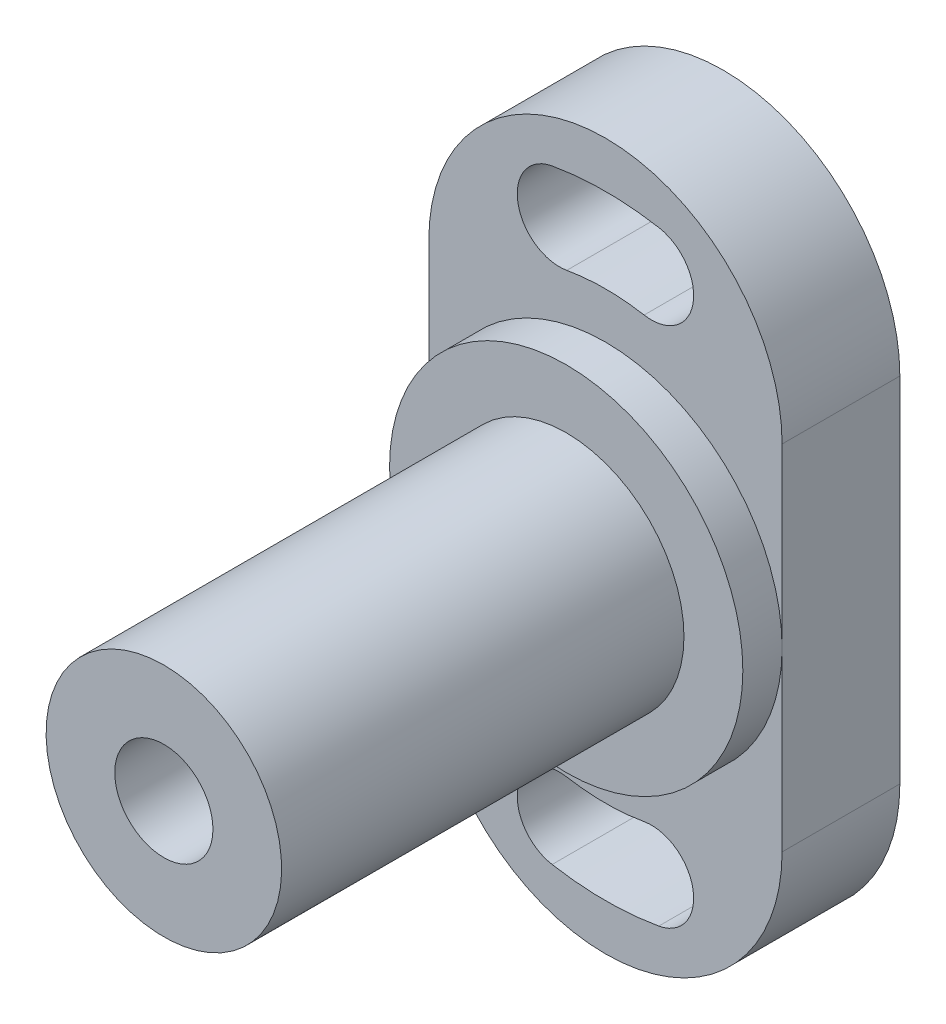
ISO-10303-21;
HEADER;
FILE_DESCRIPTION(('STEP AP214'),'2;1');
FILE_NAME('part.step','',(''),(''),'','','');
FILE_SCHEMA(('AUTOMOTIVE_DESIGN { 1 0 10303 214 1 1 1 1 }'));
ENDSEC;
DATA;
#1=APPLICATION_CONTEXT('core data for automotive mechanical design processes');
#2=APPLICATION_PROTOCOL_DEFINITION('international standard','automotive_design',2000,#1);
#3=PRODUCT_CONTEXT('',#1,'mechanical');
#4=PRODUCT('Part','Part','',(#3));
#5=PRODUCT_RELATED_PRODUCT_CATEGORY('part','',(#4));
#6=PRODUCT_DEFINITION_FORMATION('','',#4);
#7=PRODUCT_DEFINITION_CONTEXT('part definition',#1,'design');
#8=PRODUCT_DEFINITION('design','',#6,#7);
#9=PRODUCT_DEFINITION_SHAPE('','',#8);
#10=(LENGTH_UNIT() NAMED_UNIT(*) SI_UNIT(.MILLI.,.METRE.));
#11=(NAMED_UNIT(*) PLANE_ANGLE_UNIT() SI_UNIT($,.RADIAN.));
#12=(NAMED_UNIT(*) SI_UNIT($,.STERADIAN.) SOLID_ANGLE_UNIT());
#13=UNCERTAINTY_MEASURE_WITH_UNIT(LENGTH_MEASURE(1.E-05),#10,'distance_accuracy_value','');
#14=(GEOMETRIC_REPRESENTATION_CONTEXT(3) GLOBAL_UNCERTAINTY_ASSIGNED_CONTEXT((#13)) GLOBAL_UNIT_ASSIGNED_CONTEXT((#10,
#11,#12)) REPRESENTATION_CONTEXT('',''));
#15=CARTESIAN_POINT('',(0.,0.,0.));
#16=DIRECTION('',(0.,0.,1.));
#17=DIRECTION('',(1.,0.,0.));
#18=AXIS2_PLACEMENT_3D('',#15,#16,#17);
#19=CARTESIAN_POINT('',(0.,9.,6.));
#20=DIRECTION('',(0.,0.,1.));
#21=DIRECTION('',(0.,-1.,0.));
#22=AXIS2_PLACEMENT_3D('',#19,#20,#21);
#23=PLANE('',#22);
#24=CARTESIAN_POINT('',(0.,0.,6.));
#25=DIRECTION('',(0.,0.,-1.));
#26=DIRECTION('',(0.,1.,0.));
#27=AXIS2_PLACEMENT_3D('',#24,#25,#26);
#28=CIRCLE('',#27,9.);
#29=CARTESIAN_POINT('',(-9.,0.,6.));
#30=VERTEX_POINT('',#29);
#31=CARTESIAN_POINT('',(9.,0.,6.));
#32=VERTEX_POINT('',#31);
#33=EDGE_CURVE('E129',#30,#32,#28,.T.);
#34=ORIENTED_EDGE('',*,*,#33,.T.);
#35=DIRECTION('',(0.,1.,0.));
#36=VECTOR('',#35,1.);
#37=CARTESIAN_POINT('',(9.,9.,6.));
#38=LINE('',#37,#36);
#39=CARTESIAN_POINT('',(9.,9.,6.));
#40=VERTEX_POINT('',#39);
#41=EDGE_CURVE('E118',#32,#40,#38,.T.);
#42=ORIENTED_EDGE('',*,*,#41,.T.);
#43=CARTESIAN_POINT('',(0.,9.,6.));
#44=DIRECTION('',(0.,0.,1.));
#45=DIRECTION('',(0.,-1.,0.));
#46=AXIS2_PLACEMENT_3D('',#43,#44,#45);
#47=CIRCLE('',#46,9.);
#48=CARTESIAN_POINT('',(-9.,9.,6.));
#49=VERTEX_POINT('',#48);
#50=EDGE_CURVE('E213',#40,#49,#47,.T.);
#51=ORIENTED_EDGE('',*,*,#50,.T.);
#52=DIRECTION('',(0.,-1.,0.));
#53=VECTOR('',#52,1.);
#54=CARTESIAN_POINT('',(-9.,9.,6.));
#55=LINE('',#54,#53);
#56=EDGE_CURVE('E131',#49,#30,#55,.T.);
#57=ORIENTED_EDGE('',*,*,#56,.T.);
#58=EDGE_LOOP('',(#34,#42,#51,#57));
#59=FACE_BOUND('',#58,.T.);
#60=CARTESIAN_POINT('',(-2.34425039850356,13.2949046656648,6.));
#61=DIRECTION('',(0.,0.,1.));
#62=DIRECTION('',(0.,1.,0.));
#63=AXIS2_PLACEMENT_3D('',#60,#61,#62);
#64=CIRCLE('',#63,2.15);
#65=CARTESIAN_POINT('',(-2.71759398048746,15.412241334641,6.));
#66=VERTEX_POINT('',#65);
#67=CARTESIAN_POINT('',(-1.97090681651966,11.1775679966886,6.));
#68=VERTEX_POINT('',#67);
#69=EDGE_CURVE('E187',#66,#68,#64,.T.);
#70=ORIENTED_EDGE('',*,*,#69,.F.);
#71=CARTESIAN_POINT('',(0.,0.,6.));
#72=DIRECTION('',(0.,0.,1.));
#73=DIRECTION('',(0.,-1.,0.));
#74=AXIS2_PLACEMENT_3D('',#71,#72,#73);
#75=CIRCLE('',#74,15.65);
#76=CARTESIAN_POINT('',(2.71759398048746,15.412241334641,6.));
#77=VERTEX_POINT('',#76);
#78=EDGE_CURVE('E185',#77,#66,#75,.T.);
#79=ORIENTED_EDGE('',*,*,#78,.F.);
#80=CARTESIAN_POINT('',(2.34425039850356,13.2949046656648,6.));
#81=DIRECTION('',(0.,0.,1.));
#82=DIRECTION('',(0.,-1.,0.));
#83=AXIS2_PLACEMENT_3D('',#80,#81,#82);
#84=CIRCLE('',#83,2.15);
#85=CARTESIAN_POINT('',(1.97090681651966,11.1775679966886,6.));
#86=VERTEX_POINT('',#85);
#87=EDGE_CURVE('E192',#86,#77,#84,.T.);
#88=ORIENTED_EDGE('',*,*,#87,.F.);
#89=CARTESIAN_POINT('',(0.,0.,6.));
#90=DIRECTION('',(0.,0.,-1.));
#91=DIRECTION('',(0.,-1.,0.));
#92=AXIS2_PLACEMENT_3D('',#89,#90,#91);
#93=CIRCLE('',#92,11.35);
#94=EDGE_CURVE('E189',#68,#86,#93,.T.);
#95=ORIENTED_EDGE('',*,*,#94,.F.);
#96=EDGE_LOOP('',(#70,#79,#88,#95));
#97=FACE_BOUND('',#96,.T.);
#98=ADVANCED_FACE('F14',(#59,#97),#23,.T.);
#99=EDGE_CURVE('E30',#32,#30,#28,.T.);
#100=ORIENTED_EDGE('',*,*,#99,.T.);
#101=CARTESIAN_POINT('',(-9.,-9.,6.));
#102=VERTEX_POINT('',#101);
#103=EDGE_CURVE('E215',#30,#102,#55,.T.);
#104=ORIENTED_EDGE('',*,*,#103,.T.);
#105=CARTESIAN_POINT('',(0.,-9.,6.));
#106=DIRECTION('',(0.,0.,1.));
#107=DIRECTION('',(0.,1.,0.));
#108=AXIS2_PLACEMENT_3D('',#105,#106,#107);
#109=CIRCLE('',#108,9.);
#110=CARTESIAN_POINT('',(9.,-9.,6.));
#111=VERTEX_POINT('',#110);
#112=EDGE_CURVE('E113',#102,#111,#109,.T.);
#113=ORIENTED_EDGE('',*,*,#112,.T.);
#114=EDGE_CURVE('E108',#111,#32,#38,.T.);
#115=ORIENTED_EDGE('',*,*,#114,.T.);
#116=EDGE_LOOP('',(#100,#104,#113,#115));
#117=FACE_BOUND('',#116,.T.);
#118=CARTESIAN_POINT('',(0.,0.,6.));
#119=DIRECTION('',(0.,0.,-1.));
#120=DIRECTION('',(0.,1.,0.));
#121=AXIS2_PLACEMENT_3D('',#118,#119,#120);
#122=CIRCLE('',#121,11.35);
#123=CARTESIAN_POINT('',(1.97090681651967,-11.1775679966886,6.));
#124=VERTEX_POINT('',#123);
#125=CARTESIAN_POINT('',(-1.97090681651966,-11.1775679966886,6.));
#126=VERTEX_POINT('',#125);
#127=EDGE_CURVE('E158',#124,#126,#122,.T.);
#128=ORIENTED_EDGE('',*,*,#127,.F.);
#129=CARTESIAN_POINT('',(2.34425039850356,-13.2949046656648,6.));
#130=DIRECTION('',(0.,0.,1.));
#131=DIRECTION('',(0.,1.,0.));
#132=AXIS2_PLACEMENT_3D('',#129,#130,#131);
#133=CIRCLE('',#132,2.15);
#134=CARTESIAN_POINT('',(2.71759398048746,-15.412241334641,6.));
#135=VERTEX_POINT('',#134);
#136=EDGE_CURVE('E156',#135,#124,#133,.T.);
#137=ORIENTED_EDGE('',*,*,#136,.F.);
#138=CARTESIAN_POINT('',(0.,0.,6.));
#139=DIRECTION('',(0.,0.,1.));
#140=DIRECTION('',(0.,1.,0.));
#141=AXIS2_PLACEMENT_3D('',#138,#139,#140);
#142=CIRCLE('',#141,15.65);
#143=CARTESIAN_POINT('',(-2.71759398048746,-15.412241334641,6.));
#144=VERTEX_POINT('',#143);
#145=EDGE_CURVE('E162',#144,#135,#142,.T.);
#146=ORIENTED_EDGE('',*,*,#145,.F.);
#147=CARTESIAN_POINT('',(-2.34425039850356,-13.2949046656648,6.));
#148=DIRECTION('',(0.,0.,1.));
#149=DIRECTION('',(0.,-1.,0.));
#150=AXIS2_PLACEMENT_3D('',#147,#148,#149);
#151=CIRCLE('',#150,2.15);
#152=EDGE_CURVE('E160',#126,#144,#151,.T.);
#153=ORIENTED_EDGE('',*,*,#152,.F.);
#154=EDGE_LOOP('',(#128,#137,#146,#153));
#155=FACE_BOUND('',#154,.T.);
#156=ADVANCED_FACE('F110',(#117,#155),#23,.T.);
#157=CARTESIAN_POINT('',(0.,9.,0.));
#158=DIRECTION('',(0.,0.,1.));
#159=DIRECTION('',(0.,-1.,0.));
#160=AXIS2_PLACEMENT_3D('',#157,#158,#159);
#161=PLANE('',#160);
#162=CARTESIAN_POINT('',(0.,0.,0.));
#163=DIRECTION('',(0.,0.,1.));
#164=DIRECTION('',(0.,-1.,0.));
#165=AXIS2_PLACEMENT_3D('',#162,#163,#164);
#166=CIRCLE('',#165,15.65);
#167=CARTESIAN_POINT('',(2.71759398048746,15.412241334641,0.));
#168=VERTEX_POINT('',#167);
#169=CARTESIAN_POINT('',(-2.71759398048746,15.412241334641,0.));
#170=VERTEX_POINT('',#169);
#171=EDGE_CURVE('E173',#168,#170,#166,.T.);
#172=ORIENTED_EDGE('',*,*,#171,.T.);
#173=CARTESIAN_POINT('',(-2.34425039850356,13.2949046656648,0.));
#174=DIRECTION('',(0.,0.,1.));
#175=DIRECTION('',(0.,1.,0.));
#176=AXIS2_PLACEMENT_3D('',#173,#174,#175);
#177=CIRCLE('',#176,2.15);
#178=CARTESIAN_POINT('',(-1.97090681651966,11.1775679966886,0.));
#179=VERTEX_POINT('',#178);
#180=EDGE_CURVE('E176',#170,#179,#177,.T.);
#181=ORIENTED_EDGE('',*,*,#180,.T.);
#182=CARTESIAN_POINT('',(0.,0.,0.));
#183=DIRECTION('',(0.,0.,-1.));
#184=DIRECTION('',(0.,-1.,0.));
#185=AXIS2_PLACEMENT_3D('',#182,#183,#184);
#186=CIRCLE('',#185,11.35);
#187=CARTESIAN_POINT('',(1.97090681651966,11.1775679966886,0.));
#188=VERTEX_POINT('',#187);
#189=EDGE_CURVE('E179',#179,#188,#186,.T.);
#190=ORIENTED_EDGE('',*,*,#189,.T.);
#191=CARTESIAN_POINT('',(2.34425039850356,13.2949046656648,0.));
#192=DIRECTION('',(0.,0.,1.));
#193=DIRECTION('',(0.,-1.,0.));
#194=AXIS2_PLACEMENT_3D('',#191,#192,#193);
#195=CIRCLE('',#194,2.15);
#196=EDGE_CURVE('E182',#188,#168,#195,.T.);
#197=ORIENTED_EDGE('',*,*,#196,.T.);
#198=EDGE_LOOP('',(#172,#181,#190,#197));
#199=FACE_BOUND('',#198,.T.);
#200=CARTESIAN_POINT('',(0.,9.,0.));
#201=DIRECTION('',(0.,0.,1.));
#202=DIRECTION('',(0.,-1.,0.));
#203=AXIS2_PLACEMENT_3D('',#200,#201,#202);
#204=CIRCLE('',#203,9.);
#205=CARTESIAN_POINT('',(9.,9.,0.));
#206=VERTEX_POINT('',#205);
#207=CARTESIAN_POINT('',(-9.,9.,0.));
#208=VERTEX_POINT('',#207);
#209=EDGE_CURVE('E204',#206,#208,#204,.T.);
#210=ORIENTED_EDGE('',*,*,#209,.F.);
#211=DIRECTION('',(0.,1.,0.));
#212=VECTOR('',#211,1.);
#213=CARTESIAN_POINT('',(9.,9.,0.));
#214=LINE('',#213,#212);
#215=CARTESIAN_POINT('',(9.,-9.,0.));
#216=VERTEX_POINT('',#215);
#217=EDGE_CURVE('E211',#216,#206,#214,.T.);
#218=ORIENTED_EDGE('',*,*,#217,.F.);
#219=CARTESIAN_POINT('',(0.,-9.,0.));
#220=DIRECTION('',(0.,0.,1.));
#221=DIRECTION('',(0.,1.,0.));
#222=AXIS2_PLACEMENT_3D('',#219,#220,#221);
#223=CIRCLE('',#222,9.);
#224=CARTESIAN_POINT('',(-9.,-9.,0.));
#225=VERTEX_POINT('',#224);
#226=EDGE_CURVE('E209',#225,#216,#223,.T.);
#227=ORIENTED_EDGE('',*,*,#226,.F.);
#228=DIRECTION('',(0.,-1.,0.));
#229=VECTOR('',#228,1.);
#230=CARTESIAN_POINT('',(-9.,9.,0.));
#231=LINE('',#230,#229);
#232=EDGE_CURVE('E207',#208,#225,#231,.T.);
#233=ORIENTED_EDGE('',*,*,#232,.F.);
#234=EDGE_LOOP('',(#210,#218,#227,#233));
#235=FACE_BOUND('',#234,.T.);
#236=CARTESIAN_POINT('',(2.34425039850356,-13.2949046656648,0.));
#237=DIRECTION('',(0.,0.,1.));
#238=DIRECTION('',(0.,1.,0.));
#239=AXIS2_PLACEMENT_3D('',#236,#237,#238);
#240=CIRCLE('',#239,2.15);
#241=CARTESIAN_POINT('',(2.71759398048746,-15.412241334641,0.));
#242=VERTEX_POINT('',#241);
#243=CARTESIAN_POINT('',(1.97090681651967,-11.1775679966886,0.));
#244=VERTEX_POINT('',#243);
#245=EDGE_CURVE('E144',#242,#244,#240,.T.);
#246=ORIENTED_EDGE('',*,*,#245,.T.);
#247=CARTESIAN_POINT('',(0.,0.,0.));
#248=DIRECTION('',(0.,0.,-1.));
#249=DIRECTION('',(0.,1.,0.));
#250=AXIS2_PLACEMENT_3D('',#247,#248,#249);
#251=CIRCLE('',#250,11.35);
#252=CARTESIAN_POINT('',(-1.97090681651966,-11.1775679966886,0.));
#253=VERTEX_POINT('',#252);
#254=EDGE_CURVE('E147',#244,#253,#251,.T.);
#255=ORIENTED_EDGE('',*,*,#254,.T.);
#256=CARTESIAN_POINT('',(-2.34425039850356,-13.2949046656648,0.));
#257=DIRECTION('',(0.,0.,1.));
#258=DIRECTION('',(0.,-1.,0.));
#259=AXIS2_PLACEMENT_3D('',#256,#257,#258);
#260=CIRCLE('',#259,2.15);
#261=CARTESIAN_POINT('',(-2.71759398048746,-15.412241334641,0.));
#262=VERTEX_POINT('',#261);
#263=EDGE_CURVE('E150',#253,#262,#260,.T.);
#264=ORIENTED_EDGE('',*,*,#263,.T.);
#265=CARTESIAN_POINT('',(0.,0.,0.));
#266=DIRECTION('',(0.,0.,1.));
#267=DIRECTION('',(0.,1.,0.));
#268=AXIS2_PLACEMENT_3D('',#265,#266,#267);
#269=CIRCLE('',#268,15.65);
#270=EDGE_CURVE('E153',#262,#242,#269,.T.);
#271=ORIENTED_EDGE('',*,*,#270,.T.);
#272=EDGE_LOOP('',(#246,#255,#264,#271));
#273=FACE_BOUND('',#272,.T.);
#274=ADVANCED_FACE('F233',(#199,#235,#273),#161,.F.);
#275=CARTESIAN_POINT('',(0.,9.,6.));
#276=DIRECTION('',(0.,0.,-1.));
#277=DIRECTION('',(0.,1.,0.));
#278=AXIS2_PLACEMENT_3D('',#275,#276,#277);
#279=CYLINDRICAL_SURFACE('',#278,9.);
#280=ORIENTED_EDGE('',*,*,#209,.T.);
#281=DIRECTION('',(0.,0.,-1.));
#282=VECTOR('',#281,1.);
#283=CARTESIAN_POINT('',(-9.,9.,6.));
#284=LINE('',#283,#282);
#285=EDGE_CURVE('E23',#49,#208,#284,.T.);
#286=ORIENTED_EDGE('',*,*,#285,.F.);
#287=ORIENTED_EDGE('',*,*,#50,.F.);
#288=DIRECTION('',(0.,0.,-1.));
#289=VECTOR('',#288,1.);
#290=CARTESIAN_POINT('',(9.,9.,6.));
#291=LINE('',#290,#289);
#292=EDGE_CURVE('E117',#40,#206,#291,.T.);
#293=ORIENTED_EDGE('',*,*,#292,.T.);
#294=EDGE_LOOP('',(#280,#286,#287,#293));
#295=FACE_BOUND('',#294,.T.);
#296=ADVANCED_FACE('F16',(#295),#279,.T.);
#297=CARTESIAN_POINT('',(-9.,9.,6.));
#298=DIRECTION('',(1.,0.,0.));
#299=DIRECTION('',(0.,1.,0.));
#300=AXIS2_PLACEMENT_3D('',#297,#298,#299);
#301=PLANE('',#300);
#302=ORIENTED_EDGE('',*,*,#232,.T.);
#303=DIRECTION('',(0.,0.,-1.));
#304=VECTOR('',#303,1.);
#305=CARTESIAN_POINT('',(-9.,-9.,6.));
#306=LINE('',#305,#304);
#307=EDGE_CURVE('E221',#102,#225,#306,.T.);
#308=ORIENTED_EDGE('',*,*,#307,.F.);
#309=ORIENTED_EDGE('',*,*,#103,.F.);
#310=ORIENTED_EDGE('',*,*,#56,.F.);
#311=ORIENTED_EDGE('',*,*,#285,.T.);
#312=EDGE_LOOP('',(#302,#308,#309,#310,#311));
#313=FACE_BOUND('',#312,.T.);
#314=ADVANCED_FACE('F227',(#313),#301,.F.);
#315=CARTESIAN_POINT('',(0.,-9.,6.));
#316=DIRECTION('',(0.,0.,-1.));
#317=DIRECTION('',(0.,1.,0.));
#318=AXIS2_PLACEMENT_3D('',#315,#316,#317);
#319=CYLINDRICAL_SURFACE('',#318,9.);
#320=ORIENTED_EDGE('',*,*,#226,.T.);
#321=DIRECTION('',(0.,0.,-1.));
#322=VECTOR('',#321,1.);
#323=CARTESIAN_POINT('',(9.,-9.,6.));
#324=LINE('',#323,#322);
#325=EDGE_CURVE('E219',#111,#216,#324,.T.);
#326=ORIENTED_EDGE('',*,*,#325,.F.);
#327=ORIENTED_EDGE('',*,*,#112,.F.);
#328=ORIENTED_EDGE('',*,*,#307,.T.);
#329=EDGE_LOOP('',(#320,#326,#327,#328));
#330=FACE_BOUND('',#329,.T.);
#331=ADVANCED_FACE('F237',(#330),#319,.T.);
#332=CARTESIAN_POINT('',(9.,9.,6.));
#333=DIRECTION('',(-1.,0.,0.));
#334=DIRECTION('',(0.,-1.,0.));
#335=AXIS2_PLACEMENT_3D('',#332,#333,#334);
#336=PLANE('',#335);
#337=ORIENTED_EDGE('',*,*,#217,.T.);
#338=ORIENTED_EDGE('',*,*,#292,.F.);
#339=ORIENTED_EDGE('',*,*,#41,.F.);
#340=ORIENTED_EDGE('',*,*,#114,.F.);
#341=ORIENTED_EDGE('',*,*,#325,.T.);
#342=EDGE_LOOP('',(#337,#338,#339,#340,#341));
#343=FACE_BOUND('',#342,.T.);
#344=ADVANCED_FACE('F122',(#343),#336,.F.);
#345=CARTESIAN_POINT('',(0.,0.,6.));
#346=DIRECTION('',(0.,0.,-1.));
#347=DIRECTION('',(0.,1.,0.));
#348=AXIS2_PLACEMENT_3D('',#345,#346,#347);
#349=CYLINDRICAL_SURFACE('',#348,15.65);
#350=ORIENTED_EDGE('',*,*,#171,.F.);
#351=DIRECTION('',(0.,0.,-1.));
#352=VECTOR('',#351,1.);
#353=CARTESIAN_POINT('',(2.71759398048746,15.412241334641,6.));
#354=LINE('',#353,#352);
#355=EDGE_CURVE('E194',#77,#168,#354,.T.);
#356=ORIENTED_EDGE('',*,*,#355,.F.);
#357=ORIENTED_EDGE('',*,*,#78,.T.);
#358=DIRECTION('',(0.,0.,-1.));
#359=VECTOR('',#358,1.);
#360=CARTESIAN_POINT('',(-2.71759398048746,15.412241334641,6.));
#361=LINE('',#360,#359);
#362=EDGE_CURVE('E201',#66,#170,#361,.T.);
#363=ORIENTED_EDGE('',*,*,#362,.T.);
#364=EDGE_LOOP('',(#350,#356,#357,#363));
#365=FACE_BOUND('',#364,.T.);
#366=ADVANCED_FACE('F246',(#365),#349,.F.);
#367=CARTESIAN_POINT('',(-2.34425039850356,13.2949046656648,6.));
#368=DIRECTION('',(0.,0.,-1.));
#369=DIRECTION('',(0.,1.,0.));
#370=AXIS2_PLACEMENT_3D('',#367,#368,#369);
#371=CYLINDRICAL_SURFACE('',#370,2.15);
#372=ORIENTED_EDGE('',*,*,#180,.F.);
#373=ORIENTED_EDGE('',*,*,#362,.F.);
#374=ORIENTED_EDGE('',*,*,#69,.T.);
#375=DIRECTION('',(0.,0.,-1.));
#376=VECTOR('',#375,1.);
#377=CARTESIAN_POINT('',(-1.97090681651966,11.1775679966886,6.));
#378=LINE('',#377,#376);
#379=EDGE_CURVE('E199',#68,#179,#378,.T.);
#380=ORIENTED_EDGE('',*,*,#379,.T.);
#381=EDGE_LOOP('',(#372,#373,#374,#380));
#382=FACE_BOUND('',#381,.T.);
#383=ADVANCED_FACE('F260',(#382),#371,.F.);
#384=CARTESIAN_POINT('',(0.,0.,6.));
#385=DIRECTION('',(0.,0.,-1.));
#386=DIRECTION('',(0.,1.,0.));
#387=AXIS2_PLACEMENT_3D('',#384,#385,#386);
#388=CYLINDRICAL_SURFACE('',#387,11.35);
#389=ORIENTED_EDGE('',*,*,#189,.F.);
#390=ORIENTED_EDGE('',*,*,#379,.F.);
#391=ORIENTED_EDGE('',*,*,#94,.T.);
#392=DIRECTION('',(0.,0.,-1.));
#393=VECTOR('',#392,1.);
#394=CARTESIAN_POINT('',(1.97090681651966,11.1775679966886,6.));
#395=LINE('',#394,#393);
#396=EDGE_CURVE('E197',#86,#188,#395,.T.);
#397=ORIENTED_EDGE('',*,*,#396,.T.);
#398=EDGE_LOOP('',(#389,#390,#391,#397));
#399=FACE_BOUND('',#398,.T.);
#400=ADVANCED_FACE('F264',(#399),#388,.T.);
#401=CARTESIAN_POINT('',(2.34425039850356,13.2949046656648,6.));
#402=DIRECTION('',(0.,0.,-1.));
#403=DIRECTION('',(0.,1.,0.));
#404=AXIS2_PLACEMENT_3D('',#401,#402,#403);
#405=CYLINDRICAL_SURFACE('',#404,2.15);
#406=ORIENTED_EDGE('',*,*,#196,.F.);
#407=ORIENTED_EDGE('',*,*,#396,.F.);
#408=ORIENTED_EDGE('',*,*,#87,.T.);
#409=ORIENTED_EDGE('',*,*,#355,.T.);
#410=EDGE_LOOP('',(#406,#407,#408,#409));
#411=FACE_BOUND('',#410,.T.);
#412=ADVANCED_FACE('F268',(#411),#405,.F.);
#413=CARTESIAN_POINT('',(2.34425039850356,-13.2949046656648,6.));
#414=DIRECTION('',(0.,0.,-1.));
#415=DIRECTION('',(0.,1.,0.));
#416=AXIS2_PLACEMENT_3D('',#413,#414,#415);
#417=CYLINDRICAL_SURFACE('',#416,2.15);
#418=ORIENTED_EDGE('',*,*,#245,.F.);
#419=DIRECTION('',(0.,0.,-1.));
#420=VECTOR('',#419,1.);
#421=CARTESIAN_POINT('',(2.71759398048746,-15.412241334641,6.));
#422=LINE('',#421,#420);
#423=EDGE_CURVE('E164',#135,#242,#422,.T.);
#424=ORIENTED_EDGE('',*,*,#423,.F.);
#425=ORIENTED_EDGE('',*,*,#136,.T.);
#426=DIRECTION('',(0.,0.,-1.));
#427=VECTOR('',#426,1.);
#428=CARTESIAN_POINT('',(1.97090681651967,-11.1775679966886,6.));
#429=LINE('',#428,#427);
#430=EDGE_CURVE('E170',#124,#244,#429,.T.);
#431=ORIENTED_EDGE('',*,*,#430,.T.);
#432=EDGE_LOOP('',(#418,#424,#425,#431));
#433=FACE_BOUND('',#432,.T.);
#434=ADVANCED_FACE('F272',(#433),#417,.F.);
#435=CARTESIAN_POINT('',(0.,0.,6.));
#436=DIRECTION('',(0.,0.,-1.));
#437=DIRECTION('',(0.,1.,0.));
#438=AXIS2_PLACEMENT_3D('',#435,#436,#437);
#439=CYLINDRICAL_SURFACE('',#438,11.35);
#440=ORIENTED_EDGE('',*,*,#254,.F.);
#441=ORIENTED_EDGE('',*,*,#430,.F.);
#442=ORIENTED_EDGE('',*,*,#127,.T.);
#443=DIRECTION('',(0.,0.,-1.));
#444=VECTOR('',#443,1.);
#445=CARTESIAN_POINT('',(-1.97090681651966,-11.1775679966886,6.));
#446=LINE('',#445,#444);
#447=EDGE_CURVE('E168',#126,#253,#446,.T.);
#448=ORIENTED_EDGE('',*,*,#447,.T.);
#449=EDGE_LOOP('',(#440,#441,#442,#448));
#450=FACE_BOUND('',#449,.T.);
#451=ADVANCED_FACE('F276',(#450),#439,.T.);
#452=CARTESIAN_POINT('',(-2.34425039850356,-13.2949046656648,6.));
#453=DIRECTION('',(0.,0.,-1.));
#454=DIRECTION('',(0.,1.,0.));
#455=AXIS2_PLACEMENT_3D('',#452,#453,#454);
#456=CYLINDRICAL_SURFACE('',#455,2.15);
#457=ORIENTED_EDGE('',*,*,#263,.F.);
#458=ORIENTED_EDGE('',*,*,#447,.F.);
#459=ORIENTED_EDGE('',*,*,#152,.T.);
#460=DIRECTION('',(0.,0.,-1.));
#461=VECTOR('',#460,1.);
#462=CARTESIAN_POINT('',(-2.71759398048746,-15.412241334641,6.));
#463=LINE('',#462,#461);
#464=EDGE_CURVE('E38',#144,#262,#463,.T.);
#465=ORIENTED_EDGE('',*,*,#464,.T.);
#466=EDGE_LOOP('',(#457,#458,#459,#465));
#467=FACE_BOUND('',#466,.T.);
#468=ADVANCED_FACE('F280',(#467),#456,.F.);
#469=CARTESIAN_POINT('',(0.,0.,6.));
#470=DIRECTION('',(0.,0.,-1.));
#471=DIRECTION('',(0.,1.,0.));
#472=AXIS2_PLACEMENT_3D('',#469,#470,#471);
#473=CYLINDRICAL_SURFACE('',#472,15.65);
#474=ORIENTED_EDGE('',*,*,#270,.F.);
#475=ORIENTED_EDGE('',*,*,#464,.F.);
#476=ORIENTED_EDGE('',*,*,#145,.T.);
#477=ORIENTED_EDGE('',*,*,#423,.T.);
#478=EDGE_LOOP('',(#474,#475,#476,#477));
#479=FACE_BOUND('',#478,.T.);
#480=ADVANCED_FACE('F284',(#479),#473,.F.);
#481=CARTESIAN_POINT('',(6.,0.,8.));
#482=DIRECTION('',(0.,0.,1.));
#483=DIRECTION('',(0.,-1.,0.));
#484=AXIS2_PLACEMENT_3D('',#481,#482,#483);
#485=PLANE('',#484);
#486=CARTESIAN_POINT('',(0.,0.,8.));
#487=DIRECTION('',(0.,0.,1.));
#488=DIRECTION('',(0.,-1.,0.));
#489=AXIS2_PLACEMENT_3D('',#486,#487,#488);
#490=CIRCLE('',#489,6.);
#491=CARTESIAN_POINT('',(0.,-6.,8.));
#492=VERTEX_POINT('',#491);
#493=EDGE_CURVE('E9',#492,#492,#490,.F.);
#494=ORIENTED_EDGE('',*,*,#493,.T.);
#495=EDGE_LOOP('',(#494));
#496=FACE_BOUND('',#495,.T.);
#497=CARTESIAN_POINT('',(0.,0.,8.));
#498=DIRECTION('',(0.,0.,-1.));
#499=DIRECTION('',(0.,1.,0.));
#500=AXIS2_PLACEMENT_3D('',#497,#498,#499);
#501=CIRCLE('',#500,9.);
#502=CARTESIAN_POINT('',(0.,9.,8.));
#503=VERTEX_POINT('',#502);
#504=EDGE_CURVE('E135',#503,#503,#501,.T.);
#505=ORIENTED_EDGE('',*,*,#504,.F.);
#506=EDGE_LOOP('',(#505));
#507=FACE_BOUND('',#506,.T.);
#508=ADVANCED_FACE('F288',(#496,#507),#485,.T.);
#509=CARTESIAN_POINT('',(0.,0.,0.));
#510=DIRECTION('',(0.,0.,-1.));
#511=DIRECTION('',(0.,1.,0.));
#512=AXIS2_PLACEMENT_3D('',#509,#510,#511);
#513=CYLINDRICAL_SURFACE('',#512,9.);
#514=ORIENTED_EDGE('',*,*,#504,.T.);
#515=EDGE_LOOP('',(#514));
#516=FACE_BOUND('',#515,.T.);
#517=ORIENTED_EDGE('',*,*,#99,.F.);
#518=ORIENTED_EDGE('',*,*,#33,.F.);
#519=EDGE_LOOP('',(#517,#518));
#520=FACE_BOUND('',#519,.T.);
#521=ADVANCED_FACE('F134',(#516,#520),#513,.T.);
#522=CARTESIAN_POINT('',(6.,0.,28.5));
#523=DIRECTION('',(0.,0.,1.));
#524=DIRECTION('',(0.,-1.,0.));
#525=AXIS2_PLACEMENT_3D('',#522,#523,#524);
#526=PLANE('',#525);
#527=CARTESIAN_POINT('',(0.,0.,28.5));
#528=DIRECTION('',(0.,0.,1.));
#529=DIRECTION('',(0.,-1.,0.));
#530=AXIS2_PLACEMENT_3D('',#527,#528,#529);
#531=CIRCLE('',#530,2.5);
#532=CARTESIAN_POINT('',(0.,-2.50000000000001,28.5));
#533=VERTEX_POINT('',#532);
#534=EDGE_CURVE('E18',#533,#533,#531,.T.);
#535=ORIENTED_EDGE('',*,*,#534,.F.);
#536=EDGE_LOOP('',(#535));
#537=FACE_BOUND('',#536,.T.);
#538=CARTESIAN_POINT('',(0.,0.,28.5));
#539=DIRECTION('',(0.,0.,-1.));
#540=DIRECTION('',(0.,1.,0.));
#541=AXIS2_PLACEMENT_3D('',#538,#539,#540);
#542=CIRCLE('',#541,6.);
#543=CARTESIAN_POINT('',(0.,6.,28.5));
#544=VERTEX_POINT('',#543);
#545=EDGE_CURVE('E137',#544,#544,#542,.T.);
#546=ORIENTED_EDGE('',*,*,#545,.F.);
#547=EDGE_LOOP('',(#546));
#548=FACE_BOUND('',#547,.T.);
#549=ADVANCED_FACE('F289',(#537,#548),#526,.T.);
#550=CARTESIAN_POINT('',(0.,0.,0.));
#551=DIRECTION('',(0.,0.,-1.));
#552=DIRECTION('',(0.,1.,0.));
#553=AXIS2_PLACEMENT_3D('',#550,#551,#552);
#554=CYLINDRICAL_SURFACE('',#553,6.);
#555=ORIENTED_EDGE('',*,*,#493,.F.);
#556=EDGE_LOOP('',(#555));
#557=FACE_BOUND('',#556,.T.);
#558=ORIENTED_EDGE('',*,*,#545,.T.);
#559=EDGE_LOOP('',(#558));
#560=FACE_BOUND('',#559,.T.);
#561=ADVANCED_FACE('F292',(#557,#560),#554,.T.);
#562=CARTESIAN_POINT('',(0.,0.,24.2359808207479));
#563=DIRECTION('',(0.,0.,-1.));
#564=DIRECTION('',(0.76604444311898,0.642787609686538,0.));
#565=AXIS2_PLACEMENT_3D('',#562,#563,#564);
#566=CYLINDRICAL_SURFACE('',#565,2.5);
#567=ORIENTED_EDGE('',*,*,#534,.T.);
#568=EDGE_LOOP('',(#567));
#569=FACE_BOUND('',#568,.T.);
#570=CARTESIAN_POINT('',(0.,0.,6.2));
#571=DIRECTION('',(0.,0.,-1.));
#572=DIRECTION('',(0.76604444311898,0.642787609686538,0.));
#573=AXIS2_PLACEMENT_3D('',#570,#571,#572);
#574=CIRCLE('',#573,2.5);
#575=CARTESIAN_POINT('',(1.91511110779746,1.60696902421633,6.2));
#576=VERTEX_POINT('',#575);
#577=EDGE_CURVE('E140',#576,#576,#574,.T.);
#578=ORIENTED_EDGE('',*,*,#577,.T.);
#579=EDGE_LOOP('',(#578));
#580=FACE_BOUND('',#579,.T.);
#581=ADVANCED_FACE('F296',(#569,#580),#566,.F.);
#582=CARTESIAN_POINT('',(0.,0.,6.2));
#583=DIRECTION('',(0.,0.,-1.));
#584=DIRECTION('',(0.76604444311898,0.642787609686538,0.));
#585=AXIS2_PLACEMENT_3D('',#582,#583,#584);
#586=PLANE('',#585);
#587=ORIENTED_EDGE('',*,*,#577,.F.);
#588=EDGE_LOOP('',(#587));
#589=FACE_BOUND('',#588,.T.);
#590=ADVANCED_FACE('F304',(#589),#586,.F.);
#591=CLOSED_SHELL('',(#98,#156,#274,#296,#314,#331,#344,#366,#383,#400,#412,#434,#451,#468,#480,
#508,#521,#549,#561,#581,#590));
#592=MANIFOLD_SOLID_BREP('B1',#591);
#593=ADVANCED_BREP_SHAPE_REPRESENTATION('',(#18,#592),#14);
#594=SHAPE_DEFINITION_REPRESENTATION(#9,#593);
ENDSEC;
END-ISO-10303-21;
